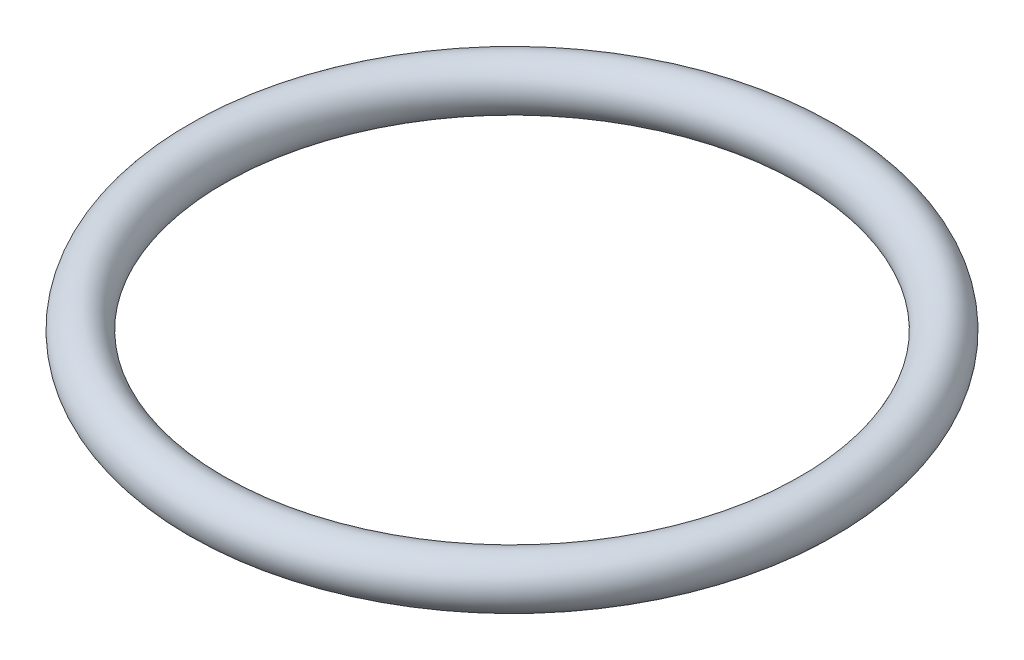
ISO-10303-21;
HEADER;
FILE_DESCRIPTION(('STEP AP214'),'2;1');
FILE_NAME('part.step','',(''),(''),'','','');
FILE_SCHEMA(('AUTOMOTIVE_DESIGN { 1 0 10303 214 1 1 1 1 }'));
ENDSEC;
DATA;
#1=APPLICATION_CONTEXT('core data for automotive mechanical design processes');
#2=APPLICATION_PROTOCOL_DEFINITION('international standard','automotive_design',2000,#1);
#3=PRODUCT_CONTEXT('',#1,'mechanical');
#4=PRODUCT('Part','Part','',(#3));
#5=PRODUCT_RELATED_PRODUCT_CATEGORY('part','',(#4));
#6=PRODUCT_DEFINITION_FORMATION('','',#4);
#7=PRODUCT_DEFINITION_CONTEXT('part definition',#1,'design');
#8=PRODUCT_DEFINITION('design','',#6,#7);
#9=PRODUCT_DEFINITION_SHAPE('','',#8);
#10=(LENGTH_UNIT() NAMED_UNIT(*) SI_UNIT(.MILLI.,.METRE.));
#11=(NAMED_UNIT(*) PLANE_ANGLE_UNIT() SI_UNIT($,.RADIAN.));
#12=(NAMED_UNIT(*) SI_UNIT($,.STERADIAN.) SOLID_ANGLE_UNIT());
#13=UNCERTAINTY_MEASURE_WITH_UNIT(LENGTH_MEASURE(1.E-05),#10,'distance_accuracy_value','');
#14=(GEOMETRIC_REPRESENTATION_CONTEXT(3) GLOBAL_UNCERTAINTY_ASSIGNED_CONTEXT((#13)) GLOBAL_UNIT_ASSIGNED_CONTEXT((#10,
#11,#12)) REPRESENTATION_CONTEXT('',''));
#15=CARTESIAN_POINT('',(0.,0.,0.));
#16=DIRECTION('',(0.,0.,1.));
#17=DIRECTION('',(1.,0.,0.));
#18=AXIS2_PLACEMENT_3D('',#15,#16,#17);
#19=CARTESIAN_POINT('',(0.,0.,0.));
#20=DIRECTION('',(0.,-1.,0.));
#21=DIRECTION('',(0.,0.,-1.));
#22=AXIS2_PLACEMENT_3D('',#19,#20,#21);
#23=TOROIDAL_SURFACE('',#22,14.45,1.15);
#24=CARTESIAN_POINT('',(0.,0.,-15.6));
#25=VERTEX_POINT('',#24);
#26=VERTEX_LOOP('',#25);
#27=FACE_BOUND('',#26,.T.);
#28=ADVANCED_FACE('F33',(#27),#23,.T.);
#29=CLOSED_SHELL('',(#28));
#30=MANIFOLD_SOLID_BREP('B2',#29);
#31=ADVANCED_BREP_SHAPE_REPRESENTATION('',(#18,#30),#14);
#32=SHAPE_DEFINITION_REPRESENTATION(#9,#31);
ENDSEC;
END-ISO-10303-21;
